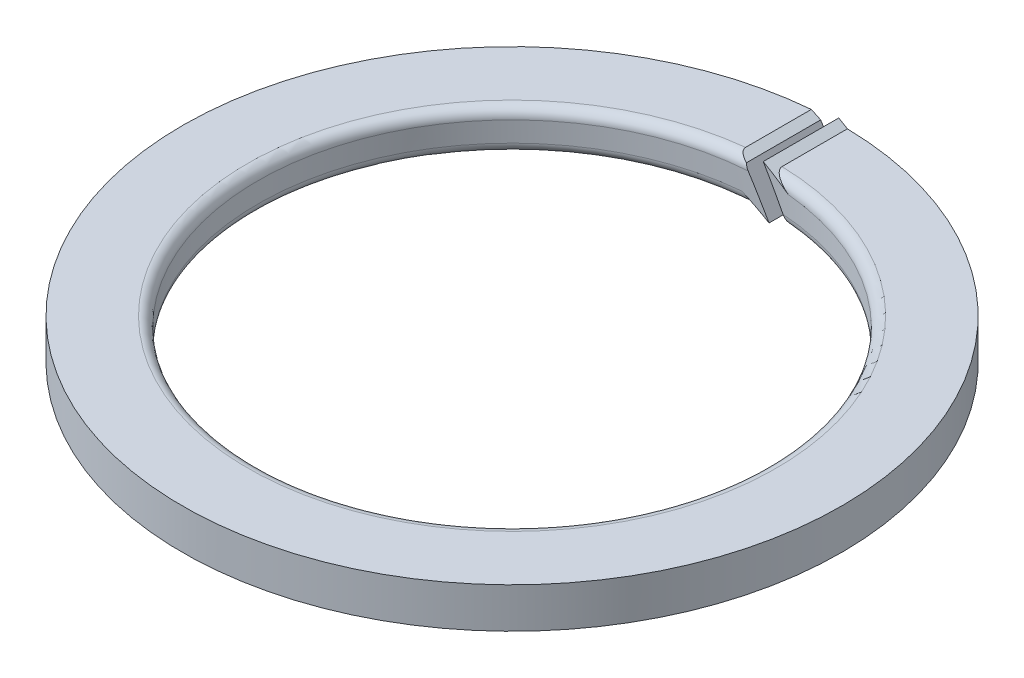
ISO-10303-21;
HEADER;
FILE_DESCRIPTION(('STEP AP214'),'2;1');
FILE_NAME('part.step','',(''),(''),'','','');
FILE_SCHEMA(('AUTOMOTIVE_DESIGN { 1 0 10303 214 1 1 1 1 }'));
ENDSEC;
DATA;
#1=APPLICATION_CONTEXT('core data for automotive mechanical design processes');
#2=APPLICATION_PROTOCOL_DEFINITION('international standard','automotive_design',2000,#1);
#3=PRODUCT_CONTEXT('',#1,'mechanical');
#4=PRODUCT('Part','Part','',(#3));
#5=PRODUCT_RELATED_PRODUCT_CATEGORY('part','',(#4));
#6=PRODUCT_DEFINITION_FORMATION('','',#4);
#7=PRODUCT_DEFINITION_CONTEXT('part definition',#1,'design');
#8=PRODUCT_DEFINITION('design','',#6,#7);
#9=PRODUCT_DEFINITION_SHAPE('','',#8);
#10=(LENGTH_UNIT() NAMED_UNIT(*) SI_UNIT(.MILLI.,.METRE.));
#11=(NAMED_UNIT(*) PLANE_ANGLE_UNIT() SI_UNIT($,.RADIAN.));
#12=(NAMED_UNIT(*) SI_UNIT($,.STERADIAN.) SOLID_ANGLE_UNIT());
#13=UNCERTAINTY_MEASURE_WITH_UNIT(LENGTH_MEASURE(1.E-05),#10,'distance_accuracy_value','');
#14=(GEOMETRIC_REPRESENTATION_CONTEXT(3) GLOBAL_UNCERTAINTY_ASSIGNED_CONTEXT((#13)) GLOBAL_UNIT_ASSIGNED_CONTEXT((#10,
#11,#12)) REPRESENTATION_CONTEXT('',''));
#15=CARTESIAN_POINT('',(0.,0.,0.));
#16=DIRECTION('',(0.,0.,1.));
#17=DIRECTION('',(1.,0.,0.));
#18=AXIS2_PLACEMENT_3D('',#15,#16,#17);
#19=CARTESIAN_POINT('',(0.,0.,0.));
#20=DIRECTION('',(0.,-1.,0.));
#21=DIRECTION('',(0.,0.,-1.));
#22=AXIS2_PLACEMENT_3D('',#19,#20,#21);
#23=CYLINDRICAL_SURFACE('',#22,65.5);
#24=CARTESIAN_POINT('',(0.,4.66666666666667,0.));
#25=DIRECTION('',(-0.499999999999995,-0.866025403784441,0.));
#26=DIRECTION('',(0.866025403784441,-0.499999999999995,0.));
#27=AXIS2_PLACEMENT_3D('',#24,#25,#26);
#28=ELLIPSE('',#27,75.6328852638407,65.5);
#29=CARTESIAN_POINT('',(1.15470053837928,3.99999999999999,-65.4898210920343));
#30=VERTEX_POINT('',#29);
#31=CARTESIAN_POINT('',(-0.577350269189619,4.99999999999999,-65.4974554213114));
#32=VERTEX_POINT('',#31);
#33=EDGE_CURVE('E124',#30,#32,#28,.F.);
#34=ORIENTED_EDGE('',*,*,#33,.F.);
#35=CARTESIAN_POINT('',(0.,3.99999999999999,0.));
#36=DIRECTION('',(0.,1.,0.));
#37=DIRECTION('',(-1.,0.,0.));
#38=AXIS2_PLACEMENT_3D('',#35,#36,#37);
#39=CIRCLE('',#38,65.5);
#40=CARTESIAN_POINT('',(-5.77350269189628,3.99999999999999,-65.2450508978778));
#41=VERTEX_POINT('',#40);
#42=EDGE_CURVE('E114',#30,#41,#39,.F.);
#43=ORIENTED_EDGE('',*,*,#42,.T.);
#44=CARTESIAN_POINT('',(0.,0.66666666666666,0.));
#45=DIRECTION('',(-0.499999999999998,-0.86602540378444,0.));
#46=DIRECTION('',(0.86602540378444,-0.499999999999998,0.));
#47=AXIS2_PLACEMENT_3D('',#44,#45,#46);
#48=ELLIPSE('',#47,75.6328852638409,65.5);
#49=CARTESIAN_POINT('',(-4.04145188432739,2.99999999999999,-65.3751991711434));
#50=VERTEX_POINT('',#49);
#51=EDGE_CURVE('E131',#50,#41,#48,.F.);
#52=ORIENTED_EDGE('',*,*,#51,.F.);
#53=CARTESIAN_POINT('',(0.,-4.,0.));
#54=DIRECTION('',(-0.866025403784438,-0.500000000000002,0.));
#55=DIRECTION('',(0.500000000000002,-0.866025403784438,0.));
#56=AXIS2_PLACEMENT_3D('',#53,#54,#55);
#57=ELLIPSE('',#56,131.,65.5);
#58=CARTESIAN_POINT('',(0.577350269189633,-5.00000000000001,-65.4974554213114));
#59=VERTEX_POINT('',#58);
#60=EDGE_CURVE('E246',#59,#50,#57,.F.);
#61=ORIENTED_EDGE('',*,*,#60,.F.);
#62=CARTESIAN_POINT('',(0.,-4.66666666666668,0.));
#63=DIRECTION('',(0.499999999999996,0.866025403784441,0.));
#64=DIRECTION('',(0.866025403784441,-0.499999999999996,0.));
#65=AXIS2_PLACEMENT_3D('',#62,#63,#64);
#66=ELLIPSE('',#65,75.6328852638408,65.5);
#67=CARTESIAN_POINT('',(-1.15470053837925,-4.00000000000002,-65.4898210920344));
#68=VERTEX_POINT('',#67);
#69=EDGE_CURVE('E248',#68,#59,#66,.F.);
#70=ORIENTED_EDGE('',*,*,#69,.F.);
#71=CARTESIAN_POINT('',(0.,-4.00000000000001,0.));
#72=DIRECTION('',(0.,-1.,0.));
#73=DIRECTION('',(1.,0.,0.));
#74=AXIS2_PLACEMENT_3D('',#71,#72,#73);
#75=CIRCLE('',#74,65.5);
#76=CARTESIAN_POINT('',(5.77350269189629,-4.00000000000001,-65.2450508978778));
#77=VERTEX_POINT('',#76);
#78=EDGE_CURVE('E123',#68,#77,#75,.F.);
#79=ORIENTED_EDGE('',*,*,#78,.T.);
#80=CARTESIAN_POINT('',(0.,-0.666666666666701,0.));
#81=DIRECTION('',(0.499999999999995,0.866025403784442,0.));
#82=DIRECTION('',(0.866025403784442,-0.499999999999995,0.));
#83=AXIS2_PLACEMENT_3D('',#80,#81,#82);
#84=ELLIPSE('',#83,75.6328852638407,65.5);
#85=CARTESIAN_POINT('',(4.04145188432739,-3.00000000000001,-65.3751991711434));
#86=VERTEX_POINT('',#85);
#87=EDGE_CURVE('E138',#86,#77,#84,.F.);
#88=ORIENTED_EDGE('',*,*,#87,.F.);
#89=CARTESIAN_POINT('',(0.,4.,0.));
#90=DIRECTION('',(0.866025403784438,0.500000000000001,0.));
#91=DIRECTION('',(0.500000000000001,-0.866025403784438,0.));
#92=AXIS2_PLACEMENT_3D('',#89,#90,#91);
#93=ELLIPSE('',#92,131.,65.5);
#94=EDGE_CURVE('E136',#32,#86,#93,.F.);
#95=ORIENTED_EDGE('',*,*,#94,.F.);
#96=EDGE_LOOP('',(#34,#43,#52,#61,#70,#79,#88,#95));
#97=FACE_BOUND('',#96,.T.);
#98=ADVANCED_FACE('F33',(#97),#23,.T.);
#99=CARTESIAN_POINT('',(0.,0.,0.));
#100=DIRECTION('',(0.,-1.,0.));
#101=DIRECTION('',(0.,0.,-1.));
#102=AXIS2_PLACEMENT_3D('',#99,#100,#101);
#103=CYLINDRICAL_SURFACE('',#102,50.5);
#104=CARTESIAN_POINT('',(0.,4.,0.));
#105=DIRECTION('',(0.866025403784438,0.500000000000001,0.));
#106=DIRECTION('',(0.500000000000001,-0.866025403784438,0.));
#107=AXIS2_PLACEMENT_3D('',#104,#105,#106);
#108=ELLIPSE('',#107,101.,50.5);
#109=CARTESIAN_POINT('',(3.46410161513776,-2.,-50.3810480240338));
#110=VERTEX_POINT('',#109);
#111=CARTESIAN_POINT('',(-0.577350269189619,4.99999999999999,-50.4966995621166));
#112=VERTEX_POINT('',#111);
#113=EDGE_CURVE('E147',#110,#112,#108,.T.);
#114=ORIENTED_EDGE('',*,*,#113,.F.);
#115=CARTESIAN_POINT('',(0.,-2.00000000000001,0.));
#116=DIRECTION('',(0.,-1.,0.));
#117=DIRECTION('',(1.,0.,0.));
#118=AXIS2_PLACEMENT_3D('',#115,#116,#117);
#119=CIRCLE('',#118,50.5);
#120=CARTESIAN_POINT('',(-4.61880215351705,-2.00000000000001,-50.2883352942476));
#121=VERTEX_POINT('',#120);
#122=EDGE_CURVE('E154',#110,#121,#119,.T.);
#123=ORIENTED_EDGE('',*,*,#122,.T.);
#124=CARTESIAN_POINT('',(0.,-4.66666666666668,0.));
#125=DIRECTION('',(0.499999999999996,0.866025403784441,0.));
#126=DIRECTION('',(0.866025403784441,-0.499999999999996,0.));
#127=AXIS2_PLACEMENT_3D('',#124,#125,#126);
#128=ELLIPSE('',#127,58.3123771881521,50.5);
#129=CARTESIAN_POINT('',(0.577350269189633,-5.00000000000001,-50.4966995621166));
#130=VERTEX_POINT('',#129);
#131=EDGE_CURVE('E145',#130,#121,#128,.T.);
#132=ORIENTED_EDGE('',*,*,#131,.F.);
#133=CARTESIAN_POINT('',(0.,-4.,0.));
#134=DIRECTION('',(-0.866025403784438,-0.500000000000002,0.));
#135=DIRECTION('',(0.500000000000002,-0.866025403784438,0.));
#136=AXIS2_PLACEMENT_3D('',#133,#134,#135);
#137=ELLIPSE('',#136,101.,50.5);
#138=CARTESIAN_POINT('',(-3.4641016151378,2.00000000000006,-50.3810480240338));
#139=VERTEX_POINT('',#138);
#140=EDGE_CURVE('E143',#139,#130,#137,.T.);
#141=ORIENTED_EDGE('',*,*,#140,.F.);
#142=CARTESIAN_POINT('',(0.,1.99999999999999,0.));
#143=DIRECTION('',(0.,1.,0.));
#144=DIRECTION('',(-1.,0.,0.));
#145=AXIS2_PLACEMENT_3D('',#142,#143,#144);
#146=CIRCLE('',#145,50.5);
#147=CARTESIAN_POINT('',(4.61880215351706,2.,-50.2883352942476));
#148=VERTEX_POINT('',#147);
#149=EDGE_CURVE('E151',#139,#148,#146,.T.);
#150=ORIENTED_EDGE('',*,*,#149,.T.);
#151=CARTESIAN_POINT('',(0.,4.66666666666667,0.));
#152=DIRECTION('',(-0.499999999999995,-0.866025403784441,0.));
#153=DIRECTION('',(0.866025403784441,-0.499999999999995,0.));
#154=AXIS2_PLACEMENT_3D('',#151,#152,#153);
#155=ELLIPSE('',#154,58.312377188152,50.5);
#156=EDGE_CURVE('E149',#112,#148,#155,.T.);
#157=ORIENTED_EDGE('',*,*,#156,.F.);
#158=EDGE_LOOP('',(#114,#123,#132,#141,#150,#157));
#159=FACE_BOUND('',#158,.T.);
#160=ADVANCED_FACE('F210',(#159),#103,.F.);
#161=CARTESIAN_POINT('',(65.5,-4.,65.5));
#162=DIRECTION('',(0.,-1.,0.));
#163=DIRECTION('',(1.,0.,0.));
#164=AXIS2_PLACEMENT_3D('',#161,#162,#163);
#165=PLANE('',#164);
#166=DIRECTION('',(0.,0.,1.));
#167=VECTOR('',#166,1.);
#168=CARTESIAN_POINT('',(-1.15470053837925,-4.00000000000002,-65.5));
#169=LINE('',#168,#167);
#170=CARTESIAN_POINT('',(-1.15470053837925,-4.00000000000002,-52.4873000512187));
#171=VERTEX_POINT('',#170);
#172=EDGE_CURVE('E229',#68,#171,#169,.T.);
#173=ORIENTED_EDGE('',*,*,#172,.T.);
#174=CARTESIAN_POINT('',(0.,-4.00000000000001,0.));
#175=DIRECTION('',(0.,-1.,0.));
#176=DIRECTION('',(1.,0.,0.));
#177=AXIS2_PLACEMENT_3D('',#174,#175,#176);
#178=CIRCLE('',#177,52.5);
#179=CARTESIAN_POINT('',(5.77350269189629,-4.00000000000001,-52.1815740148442));
#180=VERTEX_POINT('',#179);
#181=EDGE_CURVE('E157',#171,#180,#178,.F.);
#182=ORIENTED_EDGE('',*,*,#181,.T.);
#183=DIRECTION('',(0.,0.,1.));
#184=VECTOR('',#183,1.);
#185=CARTESIAN_POINT('',(5.77350269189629,-4.00000000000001,-65.5));
#186=LINE('',#185,#184);
#187=EDGE_CURVE('E234',#77,#180,#186,.T.);
#188=ORIENTED_EDGE('',*,*,#187,.F.);
#189=ORIENTED_EDGE('',*,*,#78,.F.);
#190=EDGE_LOOP('',(#173,#182,#188,#189));
#191=FACE_BOUND('',#190,.T.);
#192=ADVANCED_FACE('F207',(#191),#165,.T.);
#193=CARTESIAN_POINT('',(65.5,4.,65.5));
#194=DIRECTION('',(0.,1.,0.));
#195=DIRECTION('',(-1.,0.,0.));
#196=AXIS2_PLACEMENT_3D('',#193,#194,#195);
#197=PLANE('',#196);
#198=DIRECTION('',(0.,0.,1.));
#199=VECTOR('',#198,1.);
#200=CARTESIAN_POINT('',(1.15470053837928,3.99999999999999,-65.5));
#201=LINE('',#200,#199);
#202=CARTESIAN_POINT('',(1.15470053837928,3.99999999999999,-52.4873000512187));
#203=VERTEX_POINT('',#202);
#204=EDGE_CURVE('E117',#30,#203,#201,.T.);
#205=ORIENTED_EDGE('',*,*,#204,.T.);
#206=CARTESIAN_POINT('',(0.,3.99999999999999,0.));
#207=DIRECTION('',(0.,1.,0.));
#208=DIRECTION('',(-1.,0.,0.));
#209=AXIS2_PLACEMENT_3D('',#206,#207,#208);
#210=CIRCLE('',#209,52.5);
#211=CARTESIAN_POINT('',(-5.77350269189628,3.99999999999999,-52.1815740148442));
#212=VERTEX_POINT('',#211);
#213=EDGE_CURVE('E61',#203,#212,#210,.F.);
#214=ORIENTED_EDGE('',*,*,#213,.T.);
#215=DIRECTION('',(0.,0.,1.));
#216=VECTOR('',#215,1.);
#217=CARTESIAN_POINT('',(-5.77350269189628,3.99999999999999,-65.5));
#218=LINE('',#217,#216);
#219=EDGE_CURVE('E118',#41,#212,#218,.T.);
#220=ORIENTED_EDGE('',*,*,#219,.F.);
#221=ORIENTED_EDGE('',*,*,#42,.F.);
#222=EDGE_LOOP('',(#205,#214,#220,#221));
#223=FACE_BOUND('',#222,.T.);
#224=ADVANCED_FACE('F116',(#223),#197,.T.);
#225=CARTESIAN_POINT('',(4.04145188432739,-3.00000000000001,-65.5));
#226=DIRECTION('',(0.499999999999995,0.866025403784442,0.));
#227=DIRECTION('',(-0.866025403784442,0.499999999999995,0.));
#228=AXIS2_PLACEMENT_3D('',#225,#226,#227);
#229=PLANE('',#228);
#230=ORIENTED_EDGE('',*,*,#187,.T.);
#231=CARTESIAN_POINT('',(5.77350269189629,-4.00000000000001,-52.1815740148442));
#232=CARTESIAN_POINT('',(5.77350759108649,-4.00000282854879,-52.1528324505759));
#233=CARTESIAN_POINT('',(5.77244134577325,-3.99938723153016,-52.124101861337));
#234=CARTESIAN_POINT('',(5.76816790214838,-3.99691995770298,-52.0668648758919));
#235=CARTESIAN_POINT('',(5.76496150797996,-3.99506874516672,-52.0383583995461));
#236=CARTESIAN_POINT('',(5.75220419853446,-3.98770330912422,-51.9539177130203));
#237=CARTESIAN_POINT('',(5.73951490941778,-3.98037714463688,-51.8985769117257));
#238=CARTESIAN_POINT('',(5.70651553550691,-3.96132494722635,-51.7911580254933));
#239=CARTESIAN_POINT('',(5.68621397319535,-3.9496038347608,-51.7390763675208));
#240=CARTESIAN_POINT('',(5.63920856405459,-3.92246524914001,-51.6388694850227));
#241=CARTESIAN_POINT('',(5.61249379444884,-3.9070414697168,-51.5907512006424));
#242=CARTESIAN_POINT('',(5.5371790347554,-3.86355847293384,-51.4724396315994));
#243=CARTESIAN_POINT('',(5.48482342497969,-3.83333094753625,-51.4054465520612));
#244=CARTESIAN_POINT('',(5.37177965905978,-3.76806509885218,-51.2815659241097));
#245=CARTESIAN_POINT('',(5.31106624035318,-3.7330121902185,-51.2247102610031));
#246=CARTESIAN_POINT('',(5.19212104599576,-3.66433915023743,-51.1263703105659));
#247=CARTESIAN_POINT('',(5.13451649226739,-3.63108114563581,-51.0838540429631));
#248=CARTESIAN_POINT('',(5.01633991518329,-3.5628518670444,-51.0046595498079));
#249=CARTESIAN_POINT('',(4.95576542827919,-3.52787917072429,-50.9679862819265));
#250=CARTESIAN_POINT('',(4.83240327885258,-3.45665600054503,-50.8996515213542));
#251=CARTESIAN_POINT('',(4.76961135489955,-3.42040306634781,-50.8680004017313));
#252=CARTESIAN_POINT('',(4.64247882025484,-3.34700306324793,-50.8091386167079));
#253=CARTESIAN_POINT('',(4.5781377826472,-3.30985574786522,-50.7819291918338));
#254=CARTESIAN_POINT('',(4.43561053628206,-3.22756760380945,-50.7264758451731));
#255=CARTESIAN_POINT('',(4.35718082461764,-3.18228618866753,-50.6990731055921));
#256=CARTESIAN_POINT('',(4.19976459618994,-3.09140188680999,-50.6493842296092));
#257=CARTESIAN_POINT('',(4.12078715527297,-3.04580424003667,-50.6270599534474));
#258=CARTESIAN_POINT('',(4.04145188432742,-3.00000000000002,-50.6068308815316));
#259=B_SPLINE_CURVE_WITH_KNOTS('',3,(#231,#232,#233,#234,#235,#236,#237,#238,#239,#240,#241,
#242,#243,#244,#245,#246,#247,#248,#249,#250,#251,#252,#253,#254,#255,#256,#257,#258),
.UNSPECIFIED.,.F.,.F.,(4,2,2,2,2,2,2,2,2,2,2,2,2,4),(0.,0.0861751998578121,0.172318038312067,
0.343167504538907,0.513826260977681,0.684777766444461,0.953945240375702,1.22394494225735,
1.46043429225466,1.69712324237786,1.93429487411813,2.17153263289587,2.45523612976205,
2.73673294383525),.UNSPECIFIED.);
#260=CARTESIAN_POINT('',(4.04145188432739,-3.00000000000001,-50.6068308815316));
#261=VERTEX_POINT('',#260);
#262=EDGE_CURVE('E159',#180,#261,#259,.T.);
#263=ORIENTED_EDGE('',*,*,#262,.T.);
#264=DIRECTION('',(0.,0.,1.));
#265=VECTOR('',#264,1.);
#266=CARTESIAN_POINT('',(4.04145188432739,-3.00000000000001,-65.5));
#267=LINE('',#266,#265);
#268=EDGE_CURVE('E237',#86,#261,#267,.T.);
#269=ORIENTED_EDGE('',*,*,#268,.F.);
#270=ORIENTED_EDGE('',*,*,#87,.T.);
#271=EDGE_LOOP('',(#230,#263,#269,#270));
#272=FACE_BOUND('',#271,.T.);
#273=ADVANCED_FACE('F174',(#272),#229,.F.);
#274=CARTESIAN_POINT('',(4.04145188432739,-3.00000000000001,-65.5));
#275=DIRECTION('',(0.866025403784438,0.500000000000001,0.));
#276=DIRECTION('',(-0.500000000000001,0.866025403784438,0.));
#277=AXIS2_PLACEMENT_3D('',#274,#275,#276);
#278=PLANE('',#277);
#279=ORIENTED_EDGE('',*,*,#268,.T.);
#280=CARTESIAN_POINT('',(4.04145188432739,-3.00000000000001,-50.6068308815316));
#281=CARTESIAN_POINT('',(3.97643772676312,-2.8873921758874,-50.5467849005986));
#282=CARTESIAN_POINT('',(3.90873448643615,-2.77012672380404,-50.4988542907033));
#283=CARTESIAN_POINT('',(3.77150577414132,-2.53243962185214,-50.4273697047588));
#284=CARTESIAN_POINT('',(3.70203745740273,-2.41211696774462,-50.4033797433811));
#285=CARTESIAN_POINT('',(3.60432098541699,-2.24286707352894,-50.3854559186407));
#286=CARTESIAN_POINT('',(3.57642934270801,-2.19455733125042,-50.3821224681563));
#287=CARTESIAN_POINT('',(3.52038664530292,-2.0974885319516,-50.3789403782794));
#288=CARTESIAN_POINT('',(3.49223521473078,-2.0487288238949,-50.3791180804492));
#289=CARTESIAN_POINT('',(3.46410161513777,-2.00000000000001,-50.3810480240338));
#290=B_SPLINE_CURVE_WITH_KNOTS('',3,(#280,#281,#282,#283,#284,#285,#286,#287,#288,#289),
.UNSPECIFIED.,.F.,.F.,(4,2,2,2,4),(0.,0.42886637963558,0.849771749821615,1.01733720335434,
1.1861602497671),.UNSPECIFIED.);
#291=EDGE_CURVE('E165',#261,#110,#290,.T.);
#292=ORIENTED_EDGE('',*,*,#291,.T.);
#293=ORIENTED_EDGE('',*,*,#113,.T.);
#294=DIRECTION('',(0.,0.,1.));
#295=VECTOR('',#294,1.);
#296=CARTESIAN_POINT('',(-0.577350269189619,4.99999999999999,-65.5));
#297=LINE('',#296,#295);
#298=EDGE_CURVE('E132',#32,#112,#297,.T.);
#299=ORIENTED_EDGE('',*,*,#298,.F.);
#300=ORIENTED_EDGE('',*,*,#94,.T.);
#301=EDGE_LOOP('',(#279,#292,#293,#299,#300));
#302=FACE_BOUND('',#301,.T.);
#303=ADVANCED_FACE('F178',(#302),#278,.F.);
#304=CARTESIAN_POINT('',(-0.577350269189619,4.99999999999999,-65.5));
#305=DIRECTION('',(-0.499999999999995,-0.866025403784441,0.));
#306=DIRECTION('',(0.866025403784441,-0.499999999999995,0.));
#307=AXIS2_PLACEMENT_3D('',#304,#305,#306);
#308=PLANE('',#307);
#309=ORIENTED_EDGE('',*,*,#33,.T.);
#310=ORIENTED_EDGE('',*,*,#298,.T.);
#311=ORIENTED_EDGE('',*,*,#156,.T.);
#312=CARTESIAN_POINT('',(4.61880215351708,1.99999999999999,-50.2883352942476));
#313=CARTESIAN_POINT('',(4.51915652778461,2.0575304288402,-50.2975030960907));
#314=CARTESIAN_POINT('',(4.41965703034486,2.11497649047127,-50.3088208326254));
#315=CARTESIAN_POINT('',(4.22108081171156,2.22962452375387,-50.3358108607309));
#316=CARTESIAN_POINT('',(4.1220041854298,2.28682644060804,-50.3514840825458));
#317=CARTESIAN_POINT('',(3.92369727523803,2.40131898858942,-50.3873715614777));
#318=CARTESIAN_POINT('',(3.82447153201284,2.45860699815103,-50.4076193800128));
#319=CARTESIAN_POINT('',(3.62681933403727,2.57272154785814,-50.4527556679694));
#320=CARTESIAN_POINT('',(3.52839282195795,2.62954812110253,-50.4776438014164));
#321=CARTESIAN_POINT('',(3.33100021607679,2.74351279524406,-50.5327668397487));
#322=CARTESIAN_POINT('',(3.2320505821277,2.80064139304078,-50.563080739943));
#323=CARTESIAN_POINT('',(3.03553637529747,2.9140989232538,-50.6291900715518));
#324=CARTESIAN_POINT('',(2.93797165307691,2.97042794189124,-50.6649849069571));
#325=CARTESIAN_POINT('',(2.74495008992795,3.0818689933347,-50.74252624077));
#326=CARTESIAN_POINT('',(2.64948780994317,3.13698416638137,-50.784254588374));
#327=CARTESIAN_POINT('',(2.46103347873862,3.24578832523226,-50.8745216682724));
#328=CARTESIAN_POINT('',(2.36804008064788,3.29947808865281,-50.9230565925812));
#329=CARTESIAN_POINT('',(2.23274631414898,3.37758998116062,-51.0008490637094));
#330=CARTESIAN_POINT('',(2.18913268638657,3.40277032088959,-51.0270737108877));
#331=CARTESIAN_POINT('',(2.10285063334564,3.452585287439,-51.0815227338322));
#332=CARTESIAN_POINT('',(2.06018227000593,3.47721987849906,-51.1097472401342));
#333=CARTESIAN_POINT('',(1.93384718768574,3.55015947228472,-51.1976892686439));
#334=CARTESIAN_POINT('',(1.85184078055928,3.59750589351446,-51.2606807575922));
#335=CARTESIAN_POINT('',(1.69369425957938,3.6888118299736,-51.3977345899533));
#336=CARTESIAN_POINT('',(1.6176214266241,3.73273250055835,-51.4719018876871));
#337=CARTESIAN_POINT('',(1.47618657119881,3.81438995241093,-51.6329290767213));
#338=CARTESIAN_POINT('',(1.41079587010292,3.85214329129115,-51.7197537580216));
#339=CARTESIAN_POINT('',(1.32086979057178,3.90406213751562,-51.8685235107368));
#340=CARTESIAN_POINT('',(1.2906391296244,3.92151581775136,-51.9258481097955));
#341=CARTESIAN_POINT('',(1.23804968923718,3.95187834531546,-52.0449985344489));
#342=CARTESIAN_POINT('',(1.21566417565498,3.96480262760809,-52.1068081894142));
#343=CARTESIAN_POINT('',(1.18413794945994,3.98300430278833,-52.2214017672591));
#344=CARTESIAN_POINT('',(1.17324806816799,3.98929157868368,-52.2735342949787));
#345=CARTESIAN_POINT('',(1.1621998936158,3.99567024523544,-52.3528996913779));
#346=CARTESIAN_POINT('',(1.15939780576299,3.99728803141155,-52.3796619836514));
#347=CARTESIAN_POINT('',(1.15564524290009,3.9994545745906,-52.4333789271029));
#348=CARTESIAN_POINT('',(1.15469617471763,4.00000251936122,-52.4603337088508));
#349=CARTESIAN_POINT('',(1.15470053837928,3.99999999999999,-52.4873000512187));
#350=B_SPLINE_CURVE_WITH_KNOTS('',3,(#312,#313,#314,#315,#316,#317,#318,#319,#320,#321,#322,
#323,#324,#325,#326,#327,#328,#329,#330,#331,#332,#333,#334,#335,#336,#337,#338,#339,#340,#341,
#342,#343,#344,#345,#346,#347,#348,#349),.UNSPECIFIED.,.F.,.F.,(4,2,2,2,2,2,2,2,2,2,2,2,2,2,2,2,
2,2,4),(0.,0.346260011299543,0.692594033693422,1.04155655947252,1.3904938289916,
1.74500016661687,2.09946798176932,2.45287390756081,2.80608290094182,2.97638095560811,
3.14669013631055,3.48727124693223,3.83127709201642,4.1743436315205,4.37509479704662,
4.57515504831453,4.73540598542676,4.81620012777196,4.89705558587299),.UNSPECIFIED.);
#351=EDGE_CURVE('E11',#148,#203,#350,.T.);
#352=ORIENTED_EDGE('',*,*,#351,.T.);
#353=ORIENTED_EDGE('',*,*,#204,.F.);
#354=EDGE_LOOP('',(#309,#310,#311,#352,#353));
#355=FACE_BOUND('',#354,.T.);
#356=ADVANCED_FACE('F127',(#355),#308,.F.);
#357=CARTESIAN_POINT('',(0.577350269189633,-5.00000000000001,-65.5));
#358=DIRECTION('',(0.499999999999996,0.866025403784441,0.));
#359=DIRECTION('',(-0.866025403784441,0.499999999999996,0.));
#360=AXIS2_PLACEMENT_3D('',#357,#358,#359);
#361=PLANE('',#360);
#362=ORIENTED_EDGE('',*,*,#69,.T.);
#363=DIRECTION('',(0.,0.,1.));
#364=VECTOR('',#363,1.);
#365=CARTESIAN_POINT('',(0.577350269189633,-5.00000000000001,-65.5));
#366=LINE('',#365,#364);
#367=EDGE_CURVE('E235',#59,#130,#366,.T.);
#368=ORIENTED_EDGE('',*,*,#367,.T.);
#369=ORIENTED_EDGE('',*,*,#131,.T.);
#370=CARTESIAN_POINT('',(-4.61880215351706,-2.00000000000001,-50.2883352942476));
#371=CARTESIAN_POINT('',(-4.51915652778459,-2.05753042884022,-50.2975030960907));
#372=CARTESIAN_POINT('',(-4.41965703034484,-2.11497649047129,-50.3088208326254));
#373=CARTESIAN_POINT('',(-4.22108081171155,-2.22962452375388,-50.3358108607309));
#374=CARTESIAN_POINT('',(-4.12200418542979,-2.28682644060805,-50.3514840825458));
#375=CARTESIAN_POINT('',(-3.92369727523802,-2.40131898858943,-50.3873715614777));
#376=CARTESIAN_POINT('',(-3.82447153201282,-2.45860699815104,-50.4076193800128));
#377=CARTESIAN_POINT('',(-3.62681933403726,-2.57272154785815,-50.4527556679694));
#378=CARTESIAN_POINT('',(-3.52839282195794,-2.62954812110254,-50.4776438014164));
#379=CARTESIAN_POINT('',(-3.33100021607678,-2.74351279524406,-50.5327668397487));
#380=CARTESIAN_POINT('',(-3.23205058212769,-2.80064139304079,-50.563080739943));
#381=CARTESIAN_POINT('',(-3.03553637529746,-2.9140989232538,-50.6291900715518));
#382=CARTESIAN_POINT('',(-2.93797165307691,-2.97042794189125,-50.664984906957));
#383=CARTESIAN_POINT('',(-2.74495008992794,-3.08186899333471,-50.74252624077));
#384=CARTESIAN_POINT('',(-2.64948780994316,-3.13698416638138,-50.784254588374));
#385=CARTESIAN_POINT('',(-2.46103347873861,-3.24578832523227,-50.8745216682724));
#386=CARTESIAN_POINT('',(-2.36804008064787,-3.29947808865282,-50.9230565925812));
#387=CARTESIAN_POINT('',(-2.23274631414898,-3.37758998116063,-51.0008490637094));
#388=CARTESIAN_POINT('',(-2.18913268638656,-3.4027703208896,-51.0270737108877));
#389=CARTESIAN_POINT('',(-2.10285063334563,-3.45258528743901,-51.0815227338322));
#390=CARTESIAN_POINT('',(-2.06018227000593,-3.47721987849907,-51.1097472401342));
#391=CARTESIAN_POINT('',(-1.93384718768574,-3.55015947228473,-51.1976892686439));
#392=CARTESIAN_POINT('',(-1.85184078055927,-3.59750589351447,-51.2606807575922));
#393=CARTESIAN_POINT('',(-1.69369425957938,-3.68881182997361,-51.3977345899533));
#394=CARTESIAN_POINT('',(-1.61762142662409,-3.73273250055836,-51.4719018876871));
#395=CARTESIAN_POINT('',(-1.47618657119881,-3.81438995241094,-51.6329290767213));
#396=CARTESIAN_POINT('',(-1.41079587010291,-3.85214329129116,-51.7197537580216));
#397=CARTESIAN_POINT('',(-1.32086979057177,-3.90406213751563,-51.8685235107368));
#398=CARTESIAN_POINT('',(-1.29063912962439,-3.92151581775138,-51.9258481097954));
#399=CARTESIAN_POINT('',(-1.23804968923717,-3.95187834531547,-52.0449985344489));
#400=CARTESIAN_POINT('',(-1.21566417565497,-3.9648026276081,-52.1068081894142));
#401=CARTESIAN_POINT('',(-1.18413794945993,-3.98300430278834,-52.2214017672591));
#402=CARTESIAN_POINT('',(-1.17324806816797,-3.9892915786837,-52.2735342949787));
#403=CARTESIAN_POINT('',(-1.16219989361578,-3.99567024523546,-52.3528996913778));
#404=CARTESIAN_POINT('',(-1.15939780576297,-3.99728803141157,-52.3796619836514));
#405=CARTESIAN_POINT('',(-1.15564524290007,-3.99945457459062,-52.4333789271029));
#406=CARTESIAN_POINT('',(-1.15469617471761,-4.00000251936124,-52.4603337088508));
#407=CARTESIAN_POINT('',(-1.15470053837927,-4.00000000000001,-52.4873000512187));
#408=B_SPLINE_CURVE_WITH_KNOTS('',3,(#370,#371,#372,#373,#374,#375,#376,#377,#378,#379,#380,
#381,#382,#383,#384,#385,#386,#387,#388,#389,#390,#391,#392,#393,#394,#395,#396,#397,#398,#399,
#400,#401,#402,#403,#404,#405,#406,#407),.UNSPECIFIED.,.F.,.F.,(4,2,2,2,2,2,2,2,2,2,2,2,2,2,2,2,
2,2,4),(0.,0.346260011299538,0.692594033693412,1.04155655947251,1.39049382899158,
1.74500016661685,2.0994679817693,2.4528739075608,2.80608290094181,2.97638095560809,
3.14669013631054,3.48727124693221,3.8312770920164,4.17434363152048,4.3750947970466,
4.57515504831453,4.73540598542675,4.81620012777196,4.89705558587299),.UNSPECIFIED.);
#409=EDGE_CURVE('E46',#121,#171,#408,.T.);
#410=ORIENTED_EDGE('',*,*,#409,.T.);
#411=ORIENTED_EDGE('',*,*,#172,.F.);
#412=EDGE_LOOP('',(#362,#368,#369,#410,#411));
#413=FACE_BOUND('',#412,.T.);
#414=ADVANCED_FACE('F181',(#413),#361,.F.);
#415=CARTESIAN_POINT('',(0.577350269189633,-5.00000000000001,-65.5));
#416=DIRECTION('',(-0.866025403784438,-0.500000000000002,0.));
#417=DIRECTION('',(0.500000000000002,-0.866025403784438,0.));
#418=AXIS2_PLACEMENT_3D('',#415,#416,#417);
#419=PLANE('',#418);
#420=DIRECTION('',(0.,0.,1.));
#421=VECTOR('',#420,1.);
#422=CARTESIAN_POINT('',(-4.04145188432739,2.99999999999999,-65.5));
#423=LINE('',#422,#421);
#424=CARTESIAN_POINT('',(-4.04145188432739,2.99999999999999,-50.6068308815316));
#425=VERTEX_POINT('',#424);
#426=EDGE_CURVE('E239',#50,#425,#423,.T.);
#427=ORIENTED_EDGE('',*,*,#426,.T.);
#428=CARTESIAN_POINT('',(-4.04145188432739,2.99999999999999,-50.6068308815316));
#429=CARTESIAN_POINT('',(-3.97643772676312,2.88739217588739,-50.5467849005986));
#430=CARTESIAN_POINT('',(-3.90873448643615,2.77012672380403,-50.4988542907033));
#431=CARTESIAN_POINT('',(-3.77150577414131,2.53243962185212,-50.4273697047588));
#432=CARTESIAN_POINT('',(-3.70203745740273,2.4121169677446,-50.4033797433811));
#433=CARTESIAN_POINT('',(-3.60432098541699,2.24286707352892,-50.3854559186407));
#434=CARTESIAN_POINT('',(-3.576429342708,2.1945573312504,-50.3821224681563));
#435=CARTESIAN_POINT('',(-3.52038664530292,2.09748853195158,-50.3789403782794));
#436=CARTESIAN_POINT('',(-3.49223521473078,2.04872882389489,-50.3791180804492));
#437=CARTESIAN_POINT('',(-3.46410161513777,1.99999999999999,-50.3810480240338));
#438=B_SPLINE_CURVE_WITH_KNOTS('',3,(#428,#429,#430,#431,#432,#433,#434,#435,#436,#437),
.UNSPECIFIED.,.F.,.F.,(4,2,2,2,4),(0.,0.428866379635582,0.849771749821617,1.01733720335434,
1.18616024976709),.UNSPECIFIED.);
#439=EDGE_CURVE('E193',#425,#139,#438,.T.);
#440=ORIENTED_EDGE('',*,*,#439,.T.);
#441=ORIENTED_EDGE('',*,*,#140,.T.);
#442=ORIENTED_EDGE('',*,*,#367,.F.);
#443=ORIENTED_EDGE('',*,*,#60,.T.);
#444=EDGE_LOOP('',(#427,#440,#441,#442,#443));
#445=FACE_BOUND('',#444,.T.);
#446=ADVANCED_FACE('F185',(#445),#419,.F.);
#447=CARTESIAN_POINT('',(-5.77350269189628,3.99999999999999,-65.5));
#448=DIRECTION('',(-0.499999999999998,-0.86602540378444,0.));
#449=DIRECTION('',(0.86602540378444,-0.499999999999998,0.));
#450=AXIS2_PLACEMENT_3D('',#447,#448,#449);
#451=PLANE('',#450);
#452=ORIENTED_EDGE('',*,*,#219,.T.);
#453=CARTESIAN_POINT('',(-5.77350269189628,3.99999999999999,-52.1815740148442));
#454=CARTESIAN_POINT('',(-5.77350759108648,4.00000282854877,-52.1528324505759));
#455=CARTESIAN_POINT('',(-5.77244134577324,3.99938723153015,-52.124101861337));
#456=CARTESIAN_POINT('',(-5.76816790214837,3.99691995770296,-52.0668648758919));
#457=CARTESIAN_POINT('',(-5.76496150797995,3.9950687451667,-52.0383583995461));
#458=CARTESIAN_POINT('',(-5.75220419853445,3.9877033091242,-51.9539177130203));
#459=CARTESIAN_POINT('',(-5.73951490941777,3.98037714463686,-51.8985769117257));
#460=CARTESIAN_POINT('',(-5.7065155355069,3.96132494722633,-51.7911580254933));
#461=CARTESIAN_POINT('',(-5.68621397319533,3.94960383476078,-51.7390763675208));
#462=CARTESIAN_POINT('',(-5.63920856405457,3.92246524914,-51.6388694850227));
#463=CARTESIAN_POINT('',(-5.61249379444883,3.90704146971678,-51.5907512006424));
#464=CARTESIAN_POINT('',(-5.53717903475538,3.86355847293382,-51.4724396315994));
#465=CARTESIAN_POINT('',(-5.48482342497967,3.83333094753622,-51.4054465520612));
#466=CARTESIAN_POINT('',(-5.37177965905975,3.76806509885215,-51.2815659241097));
#467=CARTESIAN_POINT('',(-5.31106624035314,3.73301219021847,-51.224710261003));
#468=CARTESIAN_POINT('',(-5.19212104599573,3.6643391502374,-51.1263703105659));
#469=CARTESIAN_POINT('',(-5.13451649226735,3.63108114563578,-51.0838540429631));
#470=CARTESIAN_POINT('',(-5.01633991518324,3.56285186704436,-51.0046595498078));
#471=CARTESIAN_POINT('',(-4.95576542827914,3.52787917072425,-50.9679862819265));
#472=CARTESIAN_POINT('',(-4.83240327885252,3.45665600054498,-50.8996515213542));
#473=CARTESIAN_POINT('',(-4.76961135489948,3.42040306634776,-50.8680004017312));
#474=CARTESIAN_POINT('',(-4.64247882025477,3.34700306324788,-50.8091386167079));
#475=CARTESIAN_POINT('',(-4.57813778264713,3.30985574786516,-50.7819291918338));
#476=CARTESIAN_POINT('',(-4.435610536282,3.2275676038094,-50.726475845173));
#477=CARTESIAN_POINT('',(-4.35718082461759,3.18228618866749,-50.6990731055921));
#478=CARTESIAN_POINT('',(-4.19976459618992,3.09140188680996,-50.6493842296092));
#479=CARTESIAN_POINT('',(-4.12078715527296,3.04580424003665,-50.6270599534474));
#480=CARTESIAN_POINT('',(-4.04145188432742,3.00000000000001,-50.6068308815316));
#481=B_SPLINE_CURVE_WITH_KNOTS('',3,(#453,#454,#455,#456,#457,#458,#459,#460,#461,#462,#463,
#464,#465,#466,#467,#468,#469,#470,#471,#472,#473,#474,#475,#476,#477,#478,#479,#480),
.UNSPECIFIED.,.F.,.F.,(4,2,2,2,2,2,2,2,2,2,2,2,2,4),(0.,0.086175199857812,0.172318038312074,
0.343167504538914,0.513826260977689,0.684777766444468,0.953945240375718,1.22394494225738,
1.46043429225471,1.69712324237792,1.9342948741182,2.17153263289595,2.45523612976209,
2.73673294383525),.UNSPECIFIED.);
#482=EDGE_CURVE('E53',#212,#425,#481,.T.);
#483=ORIENTED_EDGE('',*,*,#482,.T.);
#484=ORIENTED_EDGE('',*,*,#426,.F.);
#485=ORIENTED_EDGE('',*,*,#51,.T.);
#486=EDGE_LOOP('',(#452,#483,#484,#485));
#487=FACE_BOUND('',#486,.T.);
#488=ADVANCED_FACE('F201',(#487),#451,.F.);
#489=CARTESIAN_POINT('',(0.,-2.00000000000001,0.));
#490=DIRECTION('',(0.,-1.,0.));
#491=DIRECTION('',(1.,0.,0.));
#492=AXIS2_PLACEMENT_3D('',#489,#490,#491);
#493=TOROIDAL_SURFACE('',#492,52.5,2.);
#494=ORIENTED_EDGE('',*,*,#262,.F.);
#495=ORIENTED_EDGE('',*,*,#181,.F.);
#496=ORIENTED_EDGE('',*,*,#409,.F.);
#497=ORIENTED_EDGE('',*,*,#122,.F.);
#498=ORIENTED_EDGE('',*,*,#291,.F.);
#499=EDGE_LOOP('',(#494,#495,#496,#497,#498));
#500=FACE_BOUND('',#499,.T.);
#501=ADVANCED_FACE('F171',(#500),#493,.T.);
#502=CARTESIAN_POINT('',(0.,1.99999999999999,0.));
#503=DIRECTION('',(0.,1.,0.));
#504=DIRECTION('',(-1.,0.,0.));
#505=AXIS2_PLACEMENT_3D('',#502,#503,#504);
#506=TOROIDAL_SURFACE('',#505,52.5,2.);
#507=ORIENTED_EDGE('',*,*,#482,.F.);
#508=ORIENTED_EDGE('',*,*,#213,.F.);
#509=ORIENTED_EDGE('',*,*,#351,.F.);
#510=ORIENTED_EDGE('',*,*,#149,.F.);
#511=ORIENTED_EDGE('',*,*,#439,.F.);
#512=EDGE_LOOP('',(#507,#508,#509,#510,#511));
#513=FACE_BOUND('',#512,.T.);
#514=ADVANCED_FACE('F35',(#513),#506,.T.);
#515=CLOSED_SHELL('',(#98,#160,#192,#224,#273,#303,#356,#414,#446,#488,#501,#514));
#516=MANIFOLD_SOLID_BREP('B2',#515);
#517=ADVANCED_BREP_SHAPE_REPRESENTATION('',(#18,#516),#14);
#518=SHAPE_DEFINITION_REPRESENTATION(#9,#517);
ENDSEC;
END-ISO-10303-21;
